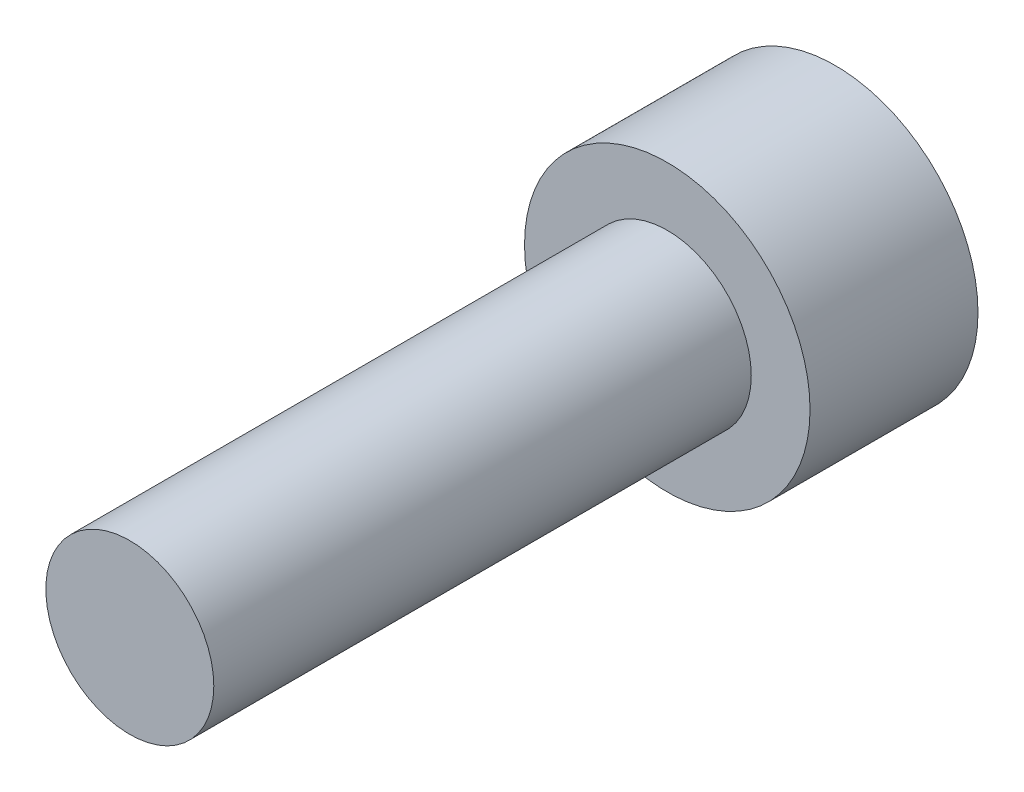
from build123d import *

# Parameters (mm, degrees)
HEX_2_DEPTH = 4


with BuildPart() as part:
    # Sketch6 → Revolve1 (revolve)
    with BuildSketch(Plane(origin=(0, 0, 0), x_dir=(0, 0, -1), z_dir=(1, 0, 0)), mode=Mode.PRIVATE) as revolve1_sk:
        Polygon((-16, 0), (-16, -2.5), (0, -2.5), (0, -4.25), (5, -4.25), (5, 0), align=None)
    revolve(revolve1_sk.sketch.rotate(Axis((0, 0, 16), (0, 0, -1)), 270), axis=Axis((0, 0, 16), (0, 0, -1)))

    # Sketch7 → HEX 2 (cut)
    with BuildSketch(Plane(origin=(0, 0, -5), x_dir=(-1, 0, 0), z_dir=(0, 0, -1))):
        Polygon((-2, 1.154700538), (-2, -1.154700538), (0, -2.309401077), (2, -1.154700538), (2, 1.154700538), (0, 2.309401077), align=None)
    extrude(amount=-HEX_2_DEPTH, mode=Mode.SUBTRACT)


solid = part.part
